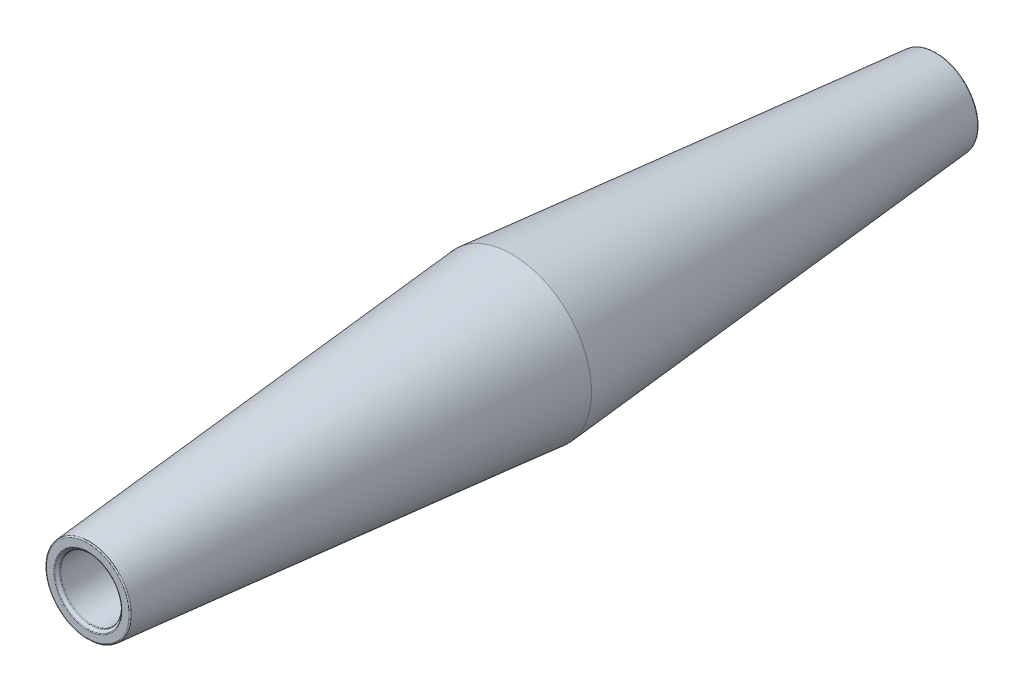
from build123d import *

# Parameters (mm, degrees)
SKIZZE1_R                       = 7
AUFSATZ_LINEAR_AUSTRAGEN1_DEPTH = 70
FORMSCHR_GE2_ANGLE              = 5
SKIZZE2_R                       = 5.05
SCHNITT_LINEAR_AUSTRAGEN1_DEPTH = 68
FASE1_SIZE                      = 0.5
VERRUNDUNG1_R                   = 0.2


with BuildPart() as part:
    # Skizze1 → Aufsatz-Linear austragen1 (new body)
    with BuildSketch(Plane.XY):
        Circle(SKIZZE1_R)
    extrude(amount=AUFSATZ_LINEAR_AUSTRAGEN1_DEPTH)

    # Formschr_ge2
    formschr_ge2_faces = [part.faces().sort_by_distance(p)[0] for p in [
        (-7, 0, 35),
    ]]
    draft(formschr_ge2_faces, Plane.XY.offset(70), FORMSCHR_GE2_ANGLE)

    # Skizze2 → Schnitt-Linear austragen1 (cut)
    with BuildSketch(Plane.XY.offset(70)):
        Circle(SKIZZE2_R)
    extrude(amount=-SCHNITT_LINEAR_AUSTRAGEN1_DEPTH, mode=Mode.SUBTRACT)

    # Fase1
    fase1_edges = [part.edges().sort_by_distance(p)[0] for p in [
        (-5.05, 0, 70),
    ]]
    chamfer(fase1_edges, length=FASE1_SIZE)

    # Spiegeln3: part across plane


with BuildPart() as part_1:
    add(part.part)
    add(part.part.mirror(Plane.XY))

    # Verrundung1
    verrundung1_edges = [part_1.edges().sort_by_distance(p)[0] for p in [
        (-5.05, 0, 69.5),
        (-5.55, 0, 70),
        (-7, 0, -70),
        (-13.124206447, 0, 0),
        (-5.05, 0, -2),
        (-5.55, 0, -70),
        (-5.05, 0, -69.5),
        (-7, 0, 70),
        (-5.05, 0, 2),
    ]]
    fillet(verrundung1_edges, radius=VERRUNDUNG1_R)


solid = part_1.part
